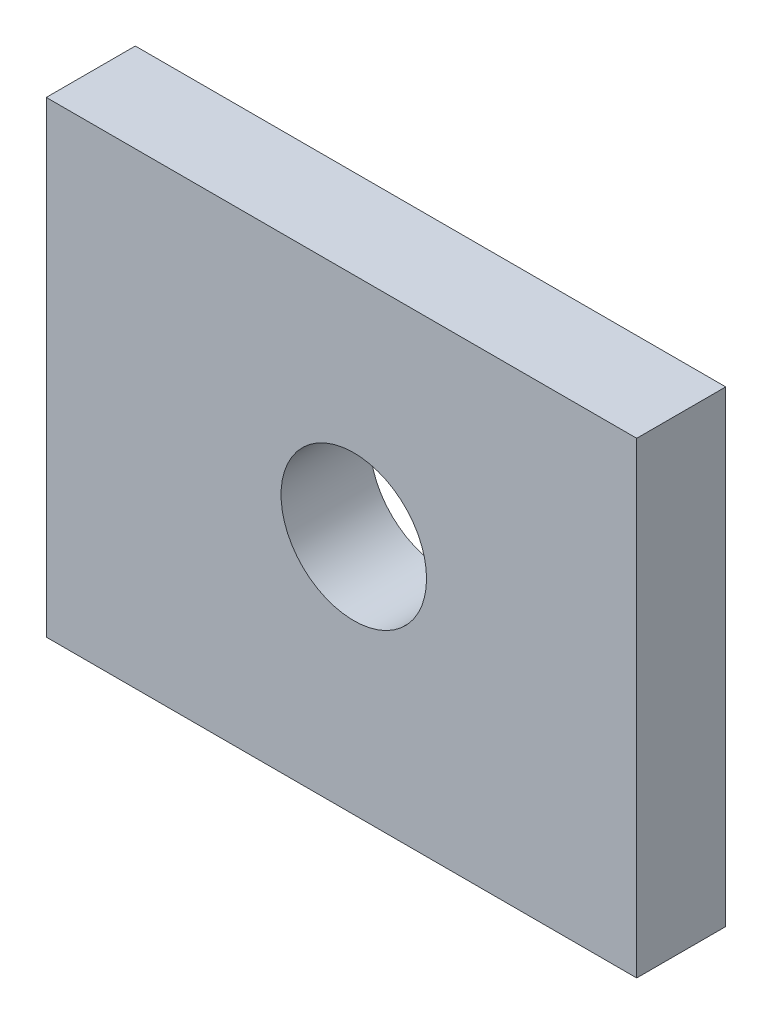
ISO-10303-21;
HEADER;
FILE_DESCRIPTION(('STEP AP214'),'2;1');
FILE_NAME('part.step','',(''),(''),'','','');
FILE_SCHEMA(('AUTOMOTIVE_DESIGN { 1 0 10303 214 1 1 1 1 }'));
ENDSEC;
DATA;
#1=APPLICATION_CONTEXT('core data for automotive mechanical design processes');
#2=APPLICATION_PROTOCOL_DEFINITION('international standard','automotive_design',2000,#1);
#3=PRODUCT_CONTEXT('',#1,'mechanical');
#4=PRODUCT('Part','Part','',(#3));
#5=PRODUCT_RELATED_PRODUCT_CATEGORY('part','',(#4));
#6=PRODUCT_DEFINITION_FORMATION('','',#4);
#7=PRODUCT_DEFINITION_CONTEXT('part definition',#1,'design');
#8=PRODUCT_DEFINITION('design','',#6,#7);
#9=PRODUCT_DEFINITION_SHAPE('','',#8);
#10=(LENGTH_UNIT() NAMED_UNIT(*) SI_UNIT(.MILLI.,.METRE.));
#11=(NAMED_UNIT(*) PLANE_ANGLE_UNIT() SI_UNIT($,.RADIAN.));
#12=(NAMED_UNIT(*) SI_UNIT($,.STERADIAN.) SOLID_ANGLE_UNIT());
#13=UNCERTAINTY_MEASURE_WITH_UNIT(LENGTH_MEASURE(1.E-05),#10,'distance_accuracy_value','');
#14=(GEOMETRIC_REPRESENTATION_CONTEXT(3) GLOBAL_UNCERTAINTY_ASSIGNED_CONTEXT((#13)) GLOBAL_UNIT_ASSIGNED_CONTEXT((#10,
#11,#12)) REPRESENTATION_CONTEXT('',''));
#15=CARTESIAN_POINT('',(0.,0.,0.));
#16=DIRECTION('',(0.,0.,1.));
#17=DIRECTION('',(1.,0.,0.));
#18=AXIS2_PLACEMENT_3D('',#15,#16,#17);
#19=CARTESIAN_POINT('',(-58.7209767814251,43.2857485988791,8.5));
#20=DIRECTION('',(1.,0.,0.));
#21=DIRECTION('',(0.,0.,-1.));
#22=AXIS2_PLACEMENT_3D('',#19,#20,#21);
#23=PLANE('',#22);
#24=DIRECTION('',(0.,-1.,0.));
#25=VECTOR('',#24,1.);
#26=CARTESIAN_POINT('',(-58.7209767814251,43.2857485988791,-8.5));
#27=LINE('',#26,#25);
#28=CARTESIAN_POINT('',(-58.7209767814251,43.2857485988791,-8.5));
#29=VERTEX_POINT('',#28);
#30=CARTESIAN_POINT('',(-58.7209767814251,-45.9701361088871,-8.5));
#31=VERTEX_POINT('',#30);
#32=EDGE_CURVE('E73',#29,#31,#27,.T.);
#33=ORIENTED_EDGE('',*,*,#32,.T.);
#34=DIRECTION('',(0.,0.,-1.));
#35=VECTOR('',#34,1.);
#36=CARTESIAN_POINT('',(-58.7209767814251,-45.9701361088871,8.5));
#37=LINE('',#36,#35);
#38=CARTESIAN_POINT('',(-58.7209767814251,-45.9701361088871,8.5));
#39=VERTEX_POINT('',#38);
#40=EDGE_CURVE('E11',#39,#31,#37,.T.);
#41=ORIENTED_EDGE('',*,*,#40,.F.);
#42=DIRECTION('',(0.,-1.,0.));
#43=VECTOR('',#42,1.);
#44=CARTESIAN_POINT('',(-58.7209767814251,43.2857485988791,8.5));
#45=LINE('',#44,#43);
#46=CARTESIAN_POINT('',(-58.7209767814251,43.2857485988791,8.5));
#47=VERTEX_POINT('',#46);
#48=EDGE_CURVE('E96',#47,#39,#45,.T.);
#49=ORIENTED_EDGE('',*,*,#48,.F.);
#50=DIRECTION('',(0.,0.,-1.));
#51=VECTOR('',#50,1.);
#52=CARTESIAN_POINT('',(-58.7209767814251,43.2857485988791,8.5));
#53=LINE('',#52,#51);
#54=EDGE_CURVE('E85',#47,#29,#53,.T.);
#55=ORIENTED_EDGE('',*,*,#54,.T.);
#56=EDGE_LOOP('',(#33,#41,#49,#55));
#57=FACE_BOUND('',#56,.T.);
#58=ADVANCED_FACE('F29',(#57),#23,.F.);
#59=CARTESIAN_POINT('',(-58.7209767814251,-45.9701361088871,8.5));
#60=DIRECTION('',(0.,1.,0.));
#61=DIRECTION('',(0.,0.,1.));
#62=AXIS2_PLACEMENT_3D('',#59,#60,#61);
#63=PLANE('',#62);
#64=DIRECTION('',(1.,0.,0.));
#65=VECTOR('',#64,1.);
#66=CARTESIAN_POINT('',(-58.7209767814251,-45.9701361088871,-8.5));
#67=LINE('',#66,#65);
#68=CARTESIAN_POINT('',(54.0232986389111,-45.9701361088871,-8.5));
#69=VERTEX_POINT('',#68);
#70=EDGE_CURVE('E69',#31,#69,#67,.T.);
#71=ORIENTED_EDGE('',*,*,#70,.T.);
#72=DIRECTION('',(0.,0.,-1.));
#73=VECTOR('',#72,1.);
#74=CARTESIAN_POINT('',(54.0232986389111,-45.9701361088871,8.5));
#75=LINE('',#74,#73);
#76=CARTESIAN_POINT('',(54.0232986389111,-45.9701361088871,8.5));
#77=VERTEX_POINT('',#76);
#78=EDGE_CURVE('E36',#77,#69,#75,.T.);
#79=ORIENTED_EDGE('',*,*,#78,.F.);
#80=DIRECTION('',(1.,0.,0.));
#81=VECTOR('',#80,1.);
#82=CARTESIAN_POINT('',(-58.7209767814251,-45.9701361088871,8.5));
#83=LINE('',#82,#81);
#84=EDGE_CURVE('E81',#39,#77,#83,.T.);
#85=ORIENTED_EDGE('',*,*,#84,.F.);
#86=ORIENTED_EDGE('',*,*,#40,.T.);
#87=EDGE_LOOP('',(#71,#79,#85,#86));
#88=FACE_BOUND('',#87,.T.);
#89=ADVANCED_FACE('F80',(#88),#63,.F.);
#90=CARTESIAN_POINT('',(54.0232986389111,43.2857485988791,8.5));
#91=DIRECTION('',(-1.,0.,0.));
#92=DIRECTION('',(0.,0.,1.));
#93=AXIS2_PLACEMENT_3D('',#90,#91,#92);
#94=PLANE('',#93);
#95=DIRECTION('',(0.,1.,0.));
#96=VECTOR('',#95,1.);
#97=CARTESIAN_POINT('',(54.0232986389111,43.2857485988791,-8.5));
#98=LINE('',#97,#96);
#99=CARTESIAN_POINT('',(54.0232986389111,43.2857485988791,-8.5));
#100=VERTEX_POINT('',#99);
#101=EDGE_CURVE('E74',#69,#100,#98,.T.);
#102=ORIENTED_EDGE('',*,*,#101,.T.);
#103=DIRECTION('',(0.,0.,-1.));
#104=VECTOR('',#103,1.);
#105=CARTESIAN_POINT('',(54.0232986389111,43.2857485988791,8.5));
#106=LINE('',#105,#104);
#107=CARTESIAN_POINT('',(54.0232986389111,43.2857485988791,8.5));
#108=VERTEX_POINT('',#107);
#109=EDGE_CURVE('E102',#108,#100,#106,.T.);
#110=ORIENTED_EDGE('',*,*,#109,.F.);
#111=DIRECTION('',(0.,1.,0.));
#112=VECTOR('',#111,1.);
#113=CARTESIAN_POINT('',(54.0232986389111,43.2857485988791,8.5));
#114=LINE('',#113,#112);
#115=EDGE_CURVE('E48',#77,#108,#114,.T.);
#116=ORIENTED_EDGE('',*,*,#115,.F.);
#117=ORIENTED_EDGE('',*,*,#78,.T.);
#118=EDGE_LOOP('',(#102,#110,#116,#117));
#119=FACE_BOUND('',#118,.T.);
#120=ADVANCED_FACE('F105',(#119),#94,.F.);
#121=CARTESIAN_POINT('',(-58.7209767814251,43.2857485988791,8.5));
#122=DIRECTION('',(0.,-1.,0.));
#123=DIRECTION('',(0.,0.,-1.));
#124=AXIS2_PLACEMENT_3D('',#121,#122,#123);
#125=PLANE('',#124);
#126=DIRECTION('',(-1.,0.,0.));
#127=VECTOR('',#126,1.);
#128=CARTESIAN_POINT('',(-58.7209767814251,43.2857485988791,-8.5));
#129=LINE('',#128,#127);
#130=EDGE_CURVE('E94',#100,#29,#129,.T.);
#131=ORIENTED_EDGE('',*,*,#130,.T.);
#132=ORIENTED_EDGE('',*,*,#54,.F.);
#133=DIRECTION('',(-1.,0.,0.));
#134=VECTOR('',#133,1.);
#135=CARTESIAN_POINT('',(-58.7209767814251,43.2857485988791,8.5));
#136=LINE('',#135,#134);
#137=EDGE_CURVE('E43',#108,#47,#136,.T.);
#138=ORIENTED_EDGE('',*,*,#137,.F.);
#139=ORIENTED_EDGE('',*,*,#109,.T.);
#140=EDGE_LOOP('',(#131,#132,#138,#139));
#141=FACE_BOUND('',#140,.T.);
#142=ADVANCED_FACE('F107',(#141),#125,.F.);
#143=CARTESIAN_POINT('',(-58.7209767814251,-45.9701361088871,8.5));
#144=DIRECTION('',(0.,0.,1.));
#145=DIRECTION('',(1.,0.,0.));
#146=AXIS2_PLACEMENT_3D('',#143,#144,#145);
#147=PLANE('',#146);
#148=CARTESIAN_POINT('',(0.,0.,8.5));
#149=DIRECTION('',(0.,0.,1.));
#150=DIRECTION('',(1.,0.,0.));
#151=AXIS2_PLACEMENT_3D('',#148,#149,#150);
#152=CIRCLE('',#151,13.8922524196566);
#153=CARTESIAN_POINT('',(13.8922524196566,0.,8.5));
#154=VERTEX_POINT('',#153);
#155=EDGE_CURVE('E89',#154,#154,#152,.T.);
#156=ORIENTED_EDGE('',*,*,#155,.F.);
#157=EDGE_LOOP('',(#156));
#158=FACE_BOUND('',#157,.T.);
#159=ORIENTED_EDGE('',*,*,#48,.T.);
#160=ORIENTED_EDGE('',*,*,#84,.T.);
#161=ORIENTED_EDGE('',*,*,#115,.T.);
#162=ORIENTED_EDGE('',*,*,#137,.T.);
#163=EDGE_LOOP('',(#159,#160,#161,#162));
#164=FACE_BOUND('',#163,.T.);
#165=ADVANCED_FACE('F108',(#158,#164),#147,.T.);
#166=CARTESIAN_POINT('',(-58.7209767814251,-45.9701361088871,-8.5));
#167=DIRECTION('',(0.,0.,1.));
#168=DIRECTION('',(1.,0.,0.));
#169=AXIS2_PLACEMENT_3D('',#166,#167,#168);
#170=PLANE('',#169);
#171=CARTESIAN_POINT('',(0.,0.,-8.5));
#172=DIRECTION('',(0.,0.,1.));
#173=DIRECTION('',(1.,0.,0.));
#174=AXIS2_PLACEMENT_3D('',#171,#172,#173);
#175=CIRCLE('',#174,13.8922524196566);
#176=CARTESIAN_POINT('',(13.8922524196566,0.,-8.5));
#177=VERTEX_POINT('',#176);
#178=EDGE_CURVE('E86',#177,#177,#175,.T.);
#179=ORIENTED_EDGE('',*,*,#178,.T.);
#180=EDGE_LOOP('',(#179));
#181=FACE_BOUND('',#180,.T.);
#182=ORIENTED_EDGE('',*,*,#32,.F.);
#183=ORIENTED_EDGE('',*,*,#130,.F.);
#184=ORIENTED_EDGE('',*,*,#101,.F.);
#185=ORIENTED_EDGE('',*,*,#70,.F.);
#186=EDGE_LOOP('',(#182,#183,#184,#185));
#187=FACE_BOUND('',#186,.T.);
#188=ADVANCED_FACE('F70',(#181,#187),#170,.F.);
#189=CARTESIAN_POINT('',(0.,0.,-8.5));
#190=DIRECTION('',(0.,0.,1.));
#191=DIRECTION('',(1.,0.,0.));
#192=AXIS2_PLACEMENT_3D('',#189,#190,#191);
#193=CYLINDRICAL_SURFACE('',#192,13.8922524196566);
#194=ORIENTED_EDGE('',*,*,#178,.F.);
#195=EDGE_LOOP('',(#194));
#196=FACE_BOUND('',#195,.T.);
#197=ORIENTED_EDGE('',*,*,#155,.T.);
#198=EDGE_LOOP('',(#197));
#199=FACE_BOUND('',#198,.T.);
#200=ADVANCED_FACE('F116',(#196,#199),#193,.F.);
#201=CLOSED_SHELL('',(#58,#89,#120,#142,#165,#188,#200));
#202=MANIFOLD_SOLID_BREP('B2',#201);
#203=ADVANCED_BREP_SHAPE_REPRESENTATION('',(#18,#202),#14);
#204=SHAPE_DEFINITION_REPRESENTATION(#9,#203);
ENDSEC;
END-ISO-10303-21;
